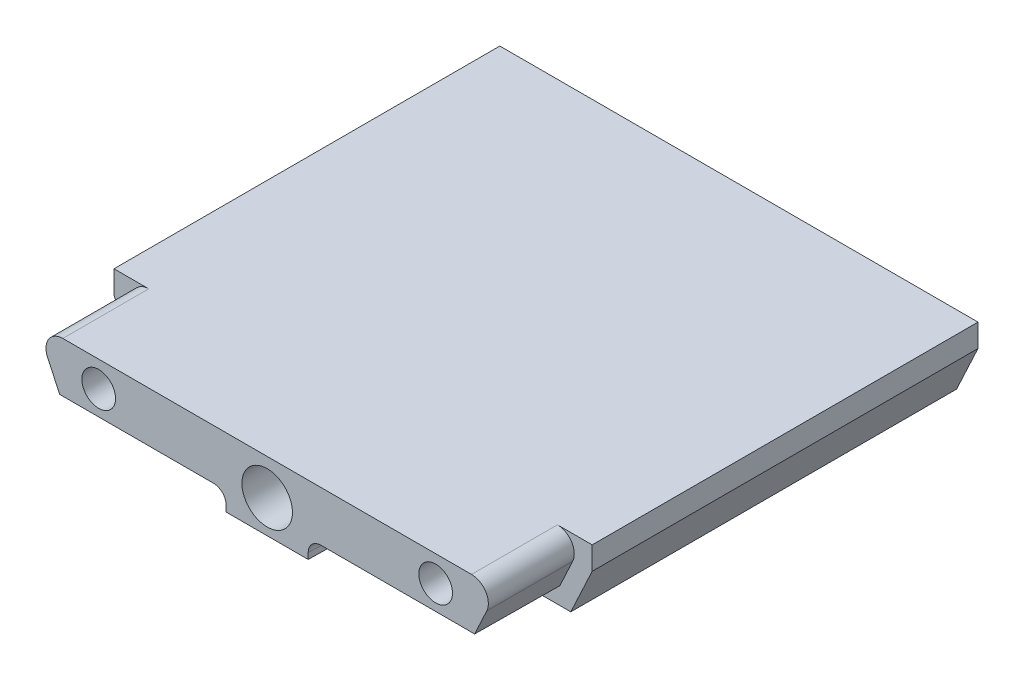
ISO-10303-21;
HEADER;
FILE_DESCRIPTION(('STEP AP214'),'2;1');
FILE_NAME('part.step','',(''),(''),'','','');
FILE_SCHEMA(('AUTOMOTIVE_DESIGN { 1 0 10303 214 1 1 1 1 }'));
ENDSEC;
DATA;
#1=APPLICATION_CONTEXT('core data for automotive mechanical design processes');
#2=APPLICATION_PROTOCOL_DEFINITION('international standard','automotive_design',2000,#1);
#3=PRODUCT_CONTEXT('',#1,'mechanical');
#4=PRODUCT('Part','Part','',(#3));
#5=PRODUCT_RELATED_PRODUCT_CATEGORY('part','',(#4));
#6=PRODUCT_DEFINITION_FORMATION('','',#4);
#7=PRODUCT_DEFINITION_CONTEXT('part definition',#1,'design');
#8=PRODUCT_DEFINITION('design','',#6,#7);
#9=PRODUCT_DEFINITION_SHAPE('','',#8);
#10=(LENGTH_UNIT() NAMED_UNIT(*) SI_UNIT(.MILLI.,.METRE.));
#11=(NAMED_UNIT(*) PLANE_ANGLE_UNIT() SI_UNIT($,.RADIAN.));
#12=(NAMED_UNIT(*) SI_UNIT($,.STERADIAN.) SOLID_ANGLE_UNIT());
#13=UNCERTAINTY_MEASURE_WITH_UNIT(LENGTH_MEASURE(1.E-05),#10,'distance_accuracy_value','');
#14=(GEOMETRIC_REPRESENTATION_CONTEXT(3) GLOBAL_UNCERTAINTY_ASSIGNED_CONTEXT((#13)) GLOBAL_UNIT_ASSIGNED_CONTEXT((#10,
#11,#12)) REPRESENTATION_CONTEXT('',''));
#15=CARTESIAN_POINT('',(0.,0.,0.));
#16=DIRECTION('',(0.,0.,1.));
#17=DIRECTION('',(1.,0.,0.));
#18=AXIS2_PLACEMENT_3D('',#15,#16,#17);
#19=CARTESIAN_POINT('',(24.5440385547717,-62.475,-10.2));
#20=DIRECTION('',(0.90630778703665,-0.422618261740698,0.));
#21=DIRECTION('',(0.422618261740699,0.90630778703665,0.));
#22=AXIS2_PLACEMENT_3D('',#19,#20,#21);
#23=PLANE('',#22);
#24=DIRECTION('',(0.422618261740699,0.90630778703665,0.));
#25=VECTOR('',#24,1.);
#26=CARTESIAN_POINT('',(52.4042644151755,-2.72855283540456,0.));
#27=LINE('',#26,#25);
#28=CARTESIAN_POINT('',(24.6270607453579,-62.2969583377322,0.));
#29=VERTEX_POINT('',#28);
#30=CARTESIAN_POINT('',(26.0712879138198,-59.1998031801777,0.));
#31=VERTEX_POINT('',#30);
#32=EDGE_CURVE('E66',#29,#31,#27,.T.);
#33=ORIENTED_EDGE('',*,*,#32,.F.);
#34=DIRECTION('',(-0.00813792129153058,-0.0174518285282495,-0.999814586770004));
#35=VECTOR('',#34,1.);
#36=CARTESIAN_POINT('',(24.5407876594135,-62.4819715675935,-10.5994008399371));
#37=LINE('',#36,#35);
#38=CARTESIAN_POINT('',(24.5440385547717,-62.475,-10.2));
#39=VERTEX_POINT('',#38);
#40=EDGE_CURVE('E166',#39,#29,#37,.F.);
#41=ORIENTED_EDGE('',*,*,#40,.F.);
#42=DIRECTION('',(0.422618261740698,0.90630778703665,0.));
#43=VECTOR('',#42,1.);
#44=CARTESIAN_POINT('',(24.5440385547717,-62.475,-10.2));
#45=LINE('',#44,#43);
#46=CARTESIAN_POINT('',(26.0712879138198,-59.1998031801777,-10.2));
#47=VERTEX_POINT('',#46);
#48=EDGE_CURVE('E109',#39,#47,#45,.T.);
#49=ORIENTED_EDGE('',*,*,#48,.T.);
#50=DIRECTION('',(0.,0.,-1.));
#51=VECTOR('',#50,1.);
#52=CARTESIAN_POINT('',(26.0712879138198,-59.1998031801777,-10.2));
#53=LINE('',#52,#51);
#54=EDGE_CURVE('E97',#31,#47,#53,.T.);
#55=ORIENTED_EDGE('',*,*,#54,.F.);
#56=EDGE_LOOP('',(#33,#41,#49,#55));
#57=FACE_BOUND('',#56,.T.);
#58=ADVANCED_FACE('F16',(#57),#23,.T.);
#59=CARTESIAN_POINT('',(24.258948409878,-56.355,-10.20006));
#60=CARTESIAN_POINT('',(24.9329806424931,-56.3550000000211,-10.20006));
#61=CARTESIAN_POINT('',(25.5862739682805,-56.7160079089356,-10.20006));
#62=CARTESIAN_POINT('',(26.3050556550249,-57.8442691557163,-10.20006));
#63=CARTESIAN_POINT('',(26.3561462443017,-58.5889225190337,-10.20006));
#64=CARTESIAN_POINT('',(26.0712879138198,-59.1998031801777,-10.20006));
#65=CARTESIAN_POINT('',(24.258948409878,-56.355,2.04003));
#66=CARTESIAN_POINT('',(24.9329806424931,-56.3550000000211,2.04003));
#67=CARTESIAN_POINT('',(25.5862739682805,-56.7160079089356,2.04003));
#68=CARTESIAN_POINT('',(26.3050556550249,-57.8442691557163,2.04003));
#69=CARTESIAN_POINT('',(26.3561462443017,-58.5889225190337,2.04003));
#70=CARTESIAN_POINT('',(26.0712879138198,-59.1998031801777,2.04003));
#71=B_SPLINE_SURFACE_WITH_KNOTS('',1,3,((#59,#60,#61,#62,#63,#64),(#65,#66,#67,#68,#69,#70)),
.UNSPECIFIED.,.F.,.F.,.F.,(2,2),(4,2,4),(0.,1.),(5.27986001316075,6.28318530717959,
7.28651060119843),.UNSPECIFIED.);
#72=CARTESIAN_POINT('',(26.0712879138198,-59.1998031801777,-10.2));
#73=CARTESIAN_POINT('',(26.0950491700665,-59.148848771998,-10.2));
#74=CARTESIAN_POINT('',(26.1165166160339,-59.096864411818,-10.2));
#75=CARTESIAN_POINT('',(26.154829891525,-58.9912444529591,-10.2));
#76=CARTESIAN_POINT('',(26.1716777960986,-58.9376096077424,-10.2));
#77=CARTESIAN_POINT('',(26.2151906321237,-58.7750687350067,-10.2));
#78=CARTESIAN_POINT('',(26.2349549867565,-58.6642431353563,-10.2));
#79=CARTESIAN_POINT('',(26.2560487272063,-58.4411030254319,-10.2));
#80=CARTESIAN_POINT('',(26.257405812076,-58.328791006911,-10.2));
#81=CARTESIAN_POINT('',(26.2420058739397,-58.1053256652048,-10.2));
#82=CARTESIAN_POINT('',(26.2252335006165,-57.9941734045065,-10.2));
#83=CARTESIAN_POINT('',(26.1727595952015,-57.7720948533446,-10.2));
#84=CARTESIAN_POINT('',(26.1363999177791,-57.6613200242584,-10.2));
#85=CARTESIAN_POINT('',(26.0677485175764,-57.5013994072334,-10.2));
#86=CARTESIAN_POINT('',(26.0425145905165,-57.449135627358,-10.2));
#87=CARTESIAN_POINT('',(25.9874124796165,-57.3471113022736,-10.2));
#88=CARTESIAN_POINT('',(25.9575447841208,-57.297350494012,-10.2));
#89=CARTESIAN_POINT('',(25.864383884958,-57.1572543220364,-10.2));
#90=CARTESIAN_POINT('',(25.7952160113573,-57.0707453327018,-10.2));
#91=CARTESIAN_POINT('',(25.6434751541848,-56.9104121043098,-10.2));
#92=CARTESIAN_POINT('',(25.5608887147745,-56.8366007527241,-10.2));
#93=CARTESIAN_POINT('',(25.3846429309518,-56.7029854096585,-10.2));
#94=CARTESIAN_POINT('',(25.2909477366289,-56.643228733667,-10.2));
#95=CARTESIAN_POINT('',(25.0950922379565,-56.539356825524,-10.2));
#96=CARTESIAN_POINT('',(24.9929206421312,-56.4952628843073,-10.2));
#97=CARTESIAN_POINT('',(24.786713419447,-56.4255933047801,-10.2));
#98=CARTESIAN_POINT('',(24.6828938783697,-56.3993812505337,-10.2));
#99=CARTESIAN_POINT('',(24.4724152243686,-56.3640635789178,-10.2));
#100=CARTESIAN_POINT('',(24.3657563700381,-56.3549564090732,-10.2));
#101=CARTESIAN_POINT('',(24.258948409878,-56.355,-10.2));
#102=B_SPLINE_CURVE_WITH_KNOTS('',3,(#72,#73,#74,#75,#76,#77,#78,#79,#80,#81,#82,#83,#84,#85,
#86,#87,#88,#89,#90,#91,#92,#93,#94,#95,#96,#97,#98,#99,#100,#101),.UNSPECIFIED.,.F.,.F.,(4,2,2,
2,2,2,2,2,2,2,2,2,2,2,4),(0.,0.168544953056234,0.337014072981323,0.673029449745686,
1.0085391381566,1.34433312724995,1.6921860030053,1.8660924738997,2.03998062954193,
2.37050011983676,2.70135311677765,3.03330448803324,3.36570538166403,3.68555405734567,
4.00537370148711),.UNSPECIFIED.);
#103=CARTESIAN_POINT('',(24.258948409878,-56.355,-10.2));
#104=VERTEX_POINT('',#103);
#105=EDGE_CURVE('E95',#47,#104,#102,.T.);
#106=DIRECTION('',(0.,0.,-1.));
#107=VECTOR('',#106,1.);
#108=CARTESIAN_POINT('',(24.258948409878,-56.355,-10.2));
#109=LINE('',#108,#107);
#110=CARTESIAN_POINT('',(24.258948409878,-56.355,0.));
#111=VERTEX_POINT('',#110);
#112=EDGE_CURVE('E76',#104,#111,#109,.F.);
#113=CARTESIAN_POINT('',(24.258948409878,-56.355,0.));
#114=CARTESIAN_POINT('',(24.315170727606,-56.3549992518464,0.));
#115=CARTESIAN_POINT('',(24.3713570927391,-56.3575126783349,0.));
#116=CARTESIAN_POINT('',(24.4832731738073,-56.3674259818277,0.));
#117=CARTESIAN_POINT('',(24.5390030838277,-56.3748236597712,0.));
#118=CARTESIAN_POINT('',(24.7047044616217,-56.4040803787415,0.));
#119=CARTESIAN_POINT('',(24.8134993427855,-56.4330047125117,0.));
#120=CARTESIAN_POINT('',(25.0246475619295,-56.5081903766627,0.));
#121=CARTESIAN_POINT('',(25.12701034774,-56.5544255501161,0.));
#122=CARTESIAN_POINT('',(25.3230304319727,-56.6628231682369,0.));
#123=CARTESIAN_POINT('',(25.4166802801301,-56.7249990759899,0.));
#124=CARTESIAN_POINT('',(25.595775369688,-56.8664110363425,0.));
#125=CARTESIAN_POINT('',(25.6808051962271,-56.9461795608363,0.));
#126=CARTESIAN_POINT('',(25.7967291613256,-57.0759842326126,0.));
#127=CARTESIAN_POINT('',(25.8334319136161,-57.1209415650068,0.));
#128=CARTESIAN_POINT('',(25.9026101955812,-57.2139983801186,0.));
#129=CARTESIAN_POINT('',(25.9350861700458,-57.2620975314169,0.));
#130=CARTESIAN_POINT('',(26.0226849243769,-57.4057371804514,0.));
#131=CARTESIAN_POINT('',(26.0718570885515,-57.5049848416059,0.));
#132=CARTESIAN_POINT('',(26.1530398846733,-57.7102685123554,0.));
#133=CARTESIAN_POINT('',(26.1850331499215,-57.8163112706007,0.));
#134=CARTESIAN_POINT('',(26.2316450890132,-58.0325124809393,0.));
#135=CARTESIAN_POINT('',(26.2462057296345,-58.1426834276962,0.));
#136=CARTESIAN_POINT('',(26.2575735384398,-58.3640869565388,0.));
#137=CARTESIAN_POINT('',(26.2543566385,-58.4753207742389,0.));
#138=CARTESIAN_POINT('',(26.2303517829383,-58.6916516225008,0.));
#139=CARTESIAN_POINT('',(26.2102319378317,-58.7968217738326,0.));
#140=CARTESIAN_POINT('',(26.1532884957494,-59.0025061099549,0.));
#141=CARTESIAN_POINT('',(26.1164664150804,-59.1030207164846,0.));
#142=CARTESIAN_POINT('',(26.0712879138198,-59.1998031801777,0.));
#143=B_SPLINE_CURVE_WITH_KNOTS('',3,(#113,#114,#115,#116,#117,#118,#119,#120,#121,#122,#123,
#124,#125,#126,#127,#128,#129,#130,#131,#132,#133,#134,#135,#136,#137,#138,#139,#140,#141,#142),
.UNSPECIFIED.,.F.,.F.,(4,2,2,2,2,2,2,2,2,2,2,2,2,2,4),(0.,0.168544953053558,0.337014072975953,
0.673029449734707,1.00853913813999,1.34433312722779,1.69218600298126,1.86609247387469,
2.03998062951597,2.37050011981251,2.70135311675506,3.03330448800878,3.36570538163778,
3.68555405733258,4.00537370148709),.UNSPECIFIED.);
#144=EDGE_CURVE('E84',#111,#31,#143,.T.);
#145=ORIENTED_EDGE('',*,*,#105,.T.);
#146=ORIENTED_EDGE('',*,*,#112,.T.);
#147=ORIENTED_EDGE('',*,*,#144,.T.);
#148=ORIENTED_EDGE('',*,*,#54,.T.);
#149=EDGE_LOOP('',(#145,#146,#147,#148));
#150=FACE_BOUND('',#149,.T.);
#151=ADVANCED_FACE('F93',(#150),#71,.T.);
#152=CARTESIAN_POINT('',(5.049,41.565,-10.2));
#153=DIRECTION('',(-0.999847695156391,0.,-0.0174524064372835));
#154=DIRECTION('',(-0.0174524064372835,0.,0.999847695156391));
#155=AXIS2_PLACEMENT_3D('',#152,#153,#154);
#156=PLANE('',#155);
#157=DIRECTION('',(0.0174524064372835,0.,-0.999847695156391));
#158=VECTOR('',#157,1.);
#159=CARTESIAN_POINT('',(5.049,-64.515,-10.2));
#160=LINE('',#159,#158);
#161=CARTESIAN_POINT('',(5.04899999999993,-64.515,-10.2));
#162=VERTEX_POINT('',#161);
#163=CARTESIAN_POINT('',(4.87095833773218,-64.515,0.));
#164=VERTEX_POINT('',#163);
#165=EDGE_CURVE('E315',#162,#164,#160,.F.);
#166=ORIENTED_EDGE('',*,*,#165,.F.);
#167=DIRECTION('',(0.,-1.,0.));
#168=VECTOR('',#167,1.);
#169=CARTESIAN_POINT('',(5.049,41.565,-10.2));
#170=LINE('',#169,#168);
#171=CARTESIAN_POINT('',(5.049,-63.9747715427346,-10.2));
#172=VERTEX_POINT('',#171);
#173=EDGE_CURVE('E222',#172,#162,#170,.T.);
#174=ORIENTED_EDGE('',*,*,#173,.F.);
#175=DIRECTION('',(0.0174497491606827,-0.0174497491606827,-0.999695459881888));
#176=VECTOR('',#175,1.);
#177=CARTESIAN_POINT('',(4.87050167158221,-63.7962732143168,0.026162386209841));
#178=LINE('',#177,#176);
#179=CARTESIAN_POINT('',(4.87095833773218,-63.7967298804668,0.));
#180=VERTEX_POINT('',#179);
#181=EDGE_CURVE('E183',#172,#180,#178,.F.);
#182=ORIENTED_EDGE('',*,*,#181,.T.);
#183=DIRECTION('',(0.,-1.,0.));
#184=VECTOR('',#183,1.);
#185=CARTESIAN_POINT('',(4.87095833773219,41.565,0.));
#186=LINE('',#185,#184);
#187=EDGE_CURVE('E20',#164,#180,#186,.F.);
#188=ORIENTED_EDGE('',*,*,#187,.F.);
#189=EDGE_LOOP('',(#166,#174,#182,#188));
#190=FACE_BOUND('',#189,.T.);
#191=ADVANCED_FACE('F128',(#190),#156,.F.);
#192=CARTESIAN_POINT('',(6.51663534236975,-63.9426353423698,-8.33273970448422));
#193=DIRECTION('',(0.0174497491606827,-0.0174497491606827,-0.999695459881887));
#194=DIRECTION('',(0.,0.999847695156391,-0.0174524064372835));
#195=AXIS2_PLACEMENT_3D('',#192,#193,#194);
#196=CYLINDRICAL_SURFACE('',#195,1.5);
#197=CARTESIAN_POINT('',(6.54922849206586,-63.9752284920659,-10.2));
#198=DIRECTION('',(0.,0.,-1.));
#199=DIRECTION('',(0.707106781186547,-0.707106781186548,0.));
#200=AXIS2_PLACEMENT_3D('',#197,#198,#199);
#201=ELLIPSE('',#200,1.50045694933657,1.5);
#202=CARTESIAN_POINT('',(6.54877154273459,-62.475,-10.2));
#203=VERTEX_POINT('',#202);
#204=EDGE_CURVE('E187',#203,#172,#201,.F.);
#205=ORIENTED_EDGE('',*,*,#204,.F.);
#206=DIRECTION('',(0.0174497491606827,-0.0174497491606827,-0.999695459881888));
#207=VECTOR('',#206,1.);
#208=CARTESIAN_POINT('',(6.54831487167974,-62.4745433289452,-10.1738373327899));
#209=LINE('',#208,#207);
#210=CARTESIAN_POINT('',(6.37072988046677,-62.2969583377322,0.));
#211=VERTEX_POINT('',#210);
#212=EDGE_CURVE('E197',#211,#203,#209,.T.);
#213=ORIENTED_EDGE('',*,*,#212,.F.);
#214=CARTESIAN_POINT('',(6.37118682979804,-63.7971868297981,0.));
#215=DIRECTION('',(0.,0.,1.));
#216=DIRECTION('',(0.707106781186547,-0.707106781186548,0.));
#217=AXIS2_PLACEMENT_3D('',#214,#215,#216);
#218=ELLIPSE('',#217,1.50045694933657,1.5);
#219=EDGE_CURVE('E209',#180,#211,#218,.F.);
#220=ORIENTED_EDGE('',*,*,#219,.F.);
#221=ORIENTED_EDGE('',*,*,#181,.F.);
#222=EDGE_LOOP('',(#205,#213,#220,#221));
#223=FACE_BOUND('',#222,.T.);
#224=ADVANCED_FACE('F454',(#223),#196,.F.);
#225=CARTESIAN_POINT('',(-24.5440385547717,-62.475,-10.2));
#226=DIRECTION('',(0.,0.999847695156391,-0.0174524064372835));
#227=DIRECTION('',(0.,0.0174524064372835,0.999847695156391));
#228=AXIS2_PLACEMENT_3D('',#225,#226,#227);
#229=PLANE('',#228);
#230=DIRECTION('',(-1.,0.,0.));
#231=VECTOR('',#230,1.);
#232=CARTESIAN_POINT('',(-24.5440385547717,-62.2969583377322,0.));
#233=LINE('',#232,#231);
#234=EDGE_CURVE('E98',#211,#29,#233,.F.);
#235=ORIENTED_EDGE('',*,*,#234,.F.);
#236=ORIENTED_EDGE('',*,*,#212,.T.);
#237=DIRECTION('',(1.,0.,0.));
#238=VECTOR('',#237,1.);
#239=CARTESIAN_POINT('',(-24.5440385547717,-62.475,-10.2));
#240=LINE('',#239,#238);
#241=EDGE_CURVE('E194',#203,#39,#240,.T.);
#242=ORIENTED_EDGE('',*,*,#241,.T.);
#243=ORIENTED_EDGE('',*,*,#40,.T.);
#244=EDGE_LOOP('',(#235,#236,#242,#243));
#245=FACE_BOUND('',#244,.T.);
#246=ADVANCED_FACE('F333',(#245),#229,.F.);
#247=CARTESIAN_POINT('',(-26.0712879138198,-59.1998031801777,-10.20006));
#248=CARTESIAN_POINT('',(-26.3561462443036,-58.5889225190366,-10.20006));
#249=CARTESIAN_POINT('',(-26.3050556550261,-57.844269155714,-10.20006));
#250=CARTESIAN_POINT('',(-25.5862739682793,-56.7160079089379,-10.20006));
#251=CARTESIAN_POINT('',(-24.932980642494,-56.3550000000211,-10.20006));
#252=CARTESIAN_POINT('',(-24.2589484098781,-56.355,-10.20006));
#253=CARTESIAN_POINT('',(-26.0712879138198,-59.1998031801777,2.04003));
#254=CARTESIAN_POINT('',(-26.3561462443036,-58.5889225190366,2.04003));
#255=CARTESIAN_POINT('',(-26.3050556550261,-57.844269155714,2.04003));
#256=CARTESIAN_POINT('',(-25.5862739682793,-56.7160079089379,2.04003));
#257=CARTESIAN_POINT('',(-24.932980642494,-56.3550000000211,2.04003));
#258=CARTESIAN_POINT('',(-24.2589484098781,-56.355,2.04003));
#259=B_SPLINE_SURFACE_WITH_KNOTS('',1,3,((#247,#248,#249,#250,#251,#252),(#253,#254,#255,#256,
#257,#258)),.UNSPECIFIED.,.F.,.F.,.F.,(2,2),(4,2,4),(0.,1.),(5.27986001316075,6.28318530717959,
7.28651060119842),.UNSPECIFIED.);
#260=CARTESIAN_POINT('',(-24.2589484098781,-56.355,-10.2));
#261=CARTESIAN_POINT('',(-24.3151707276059,-56.3549992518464,-10.2));
#262=CARTESIAN_POINT('',(-24.3713570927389,-56.3575126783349,-10.2));
#263=CARTESIAN_POINT('',(-24.4832731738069,-56.3674259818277,-10.2));
#264=CARTESIAN_POINT('',(-24.5390030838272,-56.3748236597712,-10.2));
#265=CARTESIAN_POINT('',(-24.7047044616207,-56.4040803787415,-10.2));
#266=CARTESIAN_POINT('',(-24.8134993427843,-56.4330047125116,-10.2));
#267=CARTESIAN_POINT('',(-25.0246475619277,-56.5081903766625,-10.2));
#268=CARTESIAN_POINT('',(-25.1270103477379,-56.5544255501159,-10.2));
#269=CARTESIAN_POINT('',(-25.3230304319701,-56.6628231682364,-10.2));
#270=CARTESIAN_POINT('',(-25.4166802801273,-56.7249990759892,-10.2));
#271=CARTESIAN_POINT('',(-25.5957753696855,-56.8664110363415,-10.2));
#272=CARTESIAN_POINT('',(-25.680805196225,-56.9461795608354,-10.2));
#273=CARTESIAN_POINT('',(-25.7967291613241,-57.0759842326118,-10.2));
#274=CARTESIAN_POINT('',(-25.8334319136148,-57.1209415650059,-10.2));
#275=CARTESIAN_POINT('',(-25.9026101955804,-57.2139983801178,-10.2));
#276=CARTESIAN_POINT('',(-25.9350861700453,-57.262097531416,-10.2));
#277=CARTESIAN_POINT('',(-26.0226849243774,-57.4057371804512,-10.2));
#278=CARTESIAN_POINT('',(-26.0718570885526,-57.5049848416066,-10.2));
#279=CARTESIAN_POINT('',(-26.1530398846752,-57.7102685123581,-10.2));
#280=CARTESIAN_POINT('',(-26.1850331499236,-57.8163112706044,-10.2));
#281=CARTESIAN_POINT('',(-26.2316450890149,-58.0325124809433,-10.2));
#282=CARTESIAN_POINT('',(-26.246205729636,-58.1426834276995,-10.2));
#283=CARTESIAN_POINT('',(-26.257573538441,-58.3640869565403,-10.2));
#284=CARTESIAN_POINT('',(-26.2543566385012,-58.4753207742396,-10.2));
#285=CARTESIAN_POINT('',(-26.2303517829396,-58.6916516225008,-10.2));
#286=CARTESIAN_POINT('',(-26.2102319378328,-58.7968217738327,-10.2));
#287=CARTESIAN_POINT('',(-26.1532884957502,-59.002506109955,-10.2));
#288=CARTESIAN_POINT('',(-26.1164664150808,-59.1030207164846,-10.2));
#289=CARTESIAN_POINT('',(-26.0712879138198,-59.1998031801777,-10.2));
#290=B_SPLINE_CURVE_WITH_KNOTS('',3,(#260,#261,#262,#263,#264,#265,#266,#267,#268,#269,#270,
#271,#272,#273,#274,#275,#276,#277,#278,#279,#280,#281,#282,#283,#284,#285,#286,#287,#288,#289),
.UNSPECIFIED.,.F.,.F.,(4,2,2,2,2,2,2,2,2,2,2,2,2,2,4),(0.,0.168544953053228,0.337014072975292,
0.673029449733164,1.00853913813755,1.34433312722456,1.69218600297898,1.86609247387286,
2.03998062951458,2.37050011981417,2.70135311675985,3.03330448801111,3.36570538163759,
3.68555405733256,4.00537370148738),.UNSPECIFIED.);
#291=CARTESIAN_POINT('',(-24.2589484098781,-56.355,-10.2));
#292=VERTEX_POINT('',#291);
#293=CARTESIAN_POINT('',(-26.0712879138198,-59.1998031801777,-10.2));
#294=VERTEX_POINT('',#293);
#295=EDGE_CURVE('E108',#292,#294,#290,.T.);
#296=DIRECTION('',(0.,0.,-1.));
#297=VECTOR('',#296,1.);
#298=CARTESIAN_POINT('',(-26.0712879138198,-59.1998031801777,-10.2));
#299=LINE('',#298,#297);
#300=CARTESIAN_POINT('',(-26.0712879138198,-59.1998031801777,0.));
#301=VERTEX_POINT('',#300);
#302=EDGE_CURVE('E36',#294,#301,#299,.F.);
#303=CARTESIAN_POINT('',(-26.0712879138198,-59.1998031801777,0.));
#304=CARTESIAN_POINT('',(-26.0950491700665,-59.1488487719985,0.));
#305=CARTESIAN_POINT('',(-26.1165166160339,-59.0968644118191,0.));
#306=CARTESIAN_POINT('',(-26.1548298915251,-58.9912444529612,0.));
#307=CARTESIAN_POINT('',(-26.1716777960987,-58.9376096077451,0.));
#308=CARTESIAN_POINT('',(-26.2151906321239,-58.775068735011,0.));
#309=CARTESIAN_POINT('',(-26.2349549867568,-58.6642431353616,0.));
#310=CARTESIAN_POINT('',(-26.2560487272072,-58.4411030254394,0.));
#311=CARTESIAN_POINT('',(-26.2574058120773,-58.3287910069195,0.));
#312=CARTESIAN_POINT('',(-26.2420058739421,-58.1053256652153,0.));
#313=CARTESIAN_POINT('',(-26.2252335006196,-57.9941734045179,0.));
#314=CARTESIAN_POINT('',(-26.1727595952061,-57.7720948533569,0.));
#315=CARTESIAN_POINT('',(-26.1363999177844,-57.6613200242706,0.));
#316=CARTESIAN_POINT('',(-26.0677485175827,-57.5013994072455,0.));
#317=CARTESIAN_POINT('',(-26.0425145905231,-57.4491356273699,0.));
#318=CARTESIAN_POINT('',(-25.9874124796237,-57.3471113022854,0.));
#319=CARTESIAN_POINT('',(-25.9575447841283,-57.2973504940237,0.));
#320=CARTESIAN_POINT('',(-25.8643838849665,-57.1572543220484,0.));
#321=CARTESIAN_POINT('',(-25.7952160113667,-57.070745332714,0.));
#322=CARTESIAN_POINT('',(-25.6434751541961,-56.9104121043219,0.));
#323=CARTESIAN_POINT('',(-25.5608887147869,-56.836600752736,0.));
#324=CARTESIAN_POINT('',(-25.3846429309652,-56.7029854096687,0.));
#325=CARTESIAN_POINT('',(-25.2909477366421,-56.6432287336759,0.));
#326=CARTESIAN_POINT('',(-25.095092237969,-56.5393568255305,0.));
#327=CARTESIAN_POINT('',(-24.9929206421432,-56.4952628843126,0.));
#328=CARTESIAN_POINT('',(-24.7867134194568,-56.4255933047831,0.));
#329=CARTESIAN_POINT('',(-24.6828938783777,-56.3993812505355,0.));
#330=CARTESIAN_POINT('',(-24.4724152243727,-56.3640635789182,0.));
#331=CARTESIAN_POINT('',(-24.3657563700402,-56.3549564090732,0.));
#332=CARTESIAN_POINT('',(-24.2589484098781,-56.355,0.));
#333=B_SPLINE_CURVE_WITH_KNOTS('',3,(#303,#304,#305,#306,#307,#308,#309,#310,#311,#312,#313,
#314,#315,#316,#317,#318,#319,#320,#321,#322,#323,#324,#325,#326,#327,#328,#329,#330,#331,#332),
.UNSPECIFIED.,.F.,.F.,(4,2,2,2,2,2,2,2,2,2,2,2,2,2,4),(0.,0.168544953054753,0.337014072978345,
0.673029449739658,1.00853913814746,1.34433312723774,1.69218600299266,1.86609247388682,
2.03998062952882,2.37050011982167,2.70135311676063,3.03330448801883,3.36570538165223,
3.68555405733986,4.0053737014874),.UNSPECIFIED.);
#334=CARTESIAN_POINT('',(-24.2589484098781,-56.355,0.));
#335=VERTEX_POINT('',#334);
#336=EDGE_CURVE('E91',#301,#335,#333,.T.);
#337=DIRECTION('',(0.,0.,-1.));
#338=VECTOR('',#337,1.);
#339=CARTESIAN_POINT('',(-24.2589484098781,-56.355,-10.2));
#340=LINE('',#339,#338);
#341=EDGE_CURVE('E79',#335,#292,#340,.T.);
#342=ORIENTED_EDGE('',*,*,#295,.T.);
#343=ORIENTED_EDGE('',*,*,#302,.T.);
#344=ORIENTED_EDGE('',*,*,#336,.T.);
#345=ORIENTED_EDGE('',*,*,#341,.T.);
#346=EDGE_LOOP('',(#342,#343,#344,#345));
#347=FACE_BOUND('',#346,.T.);
#348=ADVANCED_FACE('F129',(#347),#259,.T.);
#349=CARTESIAN_POINT('',(-27.3978414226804,-56.355,-10.2));
#350=DIRECTION('',(-0.90630778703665,-0.422618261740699,0.));
#351=DIRECTION('',(0.422618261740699,-0.90630778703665,0.));
#352=AXIS2_PLACEMENT_3D('',#349,#350,#351);
#353=PLANE('',#352);
#354=ORIENTED_EDGE('',*,*,#302,.F.);
#355=DIRECTION('',(0.422618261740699,-0.90630778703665,0.));
#356=VECTOR('',#355,1.);
#357=CARTESIAN_POINT('',(-27.3978414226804,-56.355,-10.2));
#358=LINE('',#357,#356);
#359=CARTESIAN_POINT('',(-24.5440385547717,-62.475,-10.2));
#360=VERTEX_POINT('',#359);
#361=EDGE_CURVE('E229',#294,#360,#358,.T.);
#362=ORIENTED_EDGE('',*,*,#361,.T.);
#363=DIRECTION('',(0.00813792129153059,-0.0174518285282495,-0.999814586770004));
#364=VECTOR('',#363,1.);
#365=CARTESIAN_POINT('',(-24.5450967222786,-62.4727307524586,-10.069994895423));
#366=LINE('',#365,#364);
#367=CARTESIAN_POINT('',(-24.6270607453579,-62.2969583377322,0.));
#368=VERTEX_POINT('',#367);
#369=EDGE_CURVE('E162',#360,#368,#366,.F.);
#370=ORIENTED_EDGE('',*,*,#369,.T.);
#371=DIRECTION('',(0.422618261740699,-0.90630778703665,0.));
#372=VECTOR('',#371,1.);
#373=CARTESIAN_POINT('',(-85.1963618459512,67.5943270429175,0.));
#374=LINE('',#373,#372);
#375=EDGE_CURVE('E82',#301,#368,#374,.T.);
#376=ORIENTED_EDGE('',*,*,#375,.F.);
#377=EDGE_LOOP('',(#354,#362,#370,#376));
#378=FACE_BOUND('',#377,.T.);
#379=ADVANCED_FACE('F18',(#378),#353,.T.);
#380=CARTESIAN_POINT('',(-24.5440385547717,-62.475,-10.2));
#381=DIRECTION('',(0.,0.999847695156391,-0.0174524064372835));
#382=DIRECTION('',(0.,0.0174524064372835,0.999847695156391));
#383=AXIS2_PLACEMENT_3D('',#380,#381,#382);
#384=PLANE('',#383);
#385=DIRECTION('',(1.,0.,0.));
#386=VECTOR('',#385,1.);
#387=CARTESIAN_POINT('',(-24.5440385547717,-62.475,-10.2));
#388=LINE('',#387,#386);
#389=CARTESIAN_POINT('',(-6.54877154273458,-62.475,-10.2));
#390=VERTEX_POINT('',#389);
#391=EDGE_CURVE('E231',#360,#390,#388,.T.);
#392=ORIENTED_EDGE('',*,*,#391,.T.);
#393=DIRECTION('',(0.0174497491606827,0.0174497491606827,0.999695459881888));
#394=VECTOR('',#393,1.);
#395=CARTESIAN_POINT('',(-6.37027320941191,-62.2965016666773,0.0261626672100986));
#396=LINE('',#395,#394);
#397=CARTESIAN_POINT('',(-6.37072988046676,-62.2969583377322,0.));
#398=VERTEX_POINT('',#397);
#399=EDGE_CURVE('E203',#390,#398,#396,.T.);
#400=ORIENTED_EDGE('',*,*,#399,.T.);
#401=DIRECTION('',(-1.,0.,0.));
#402=VECTOR('',#401,1.);
#403=CARTESIAN_POINT('',(-24.5440385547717,-62.2969583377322,0.));
#404=LINE('',#403,#402);
#405=EDGE_CURVE('E81',#368,#398,#404,.F.);
#406=ORIENTED_EDGE('',*,*,#405,.F.);
#407=ORIENTED_EDGE('',*,*,#369,.F.);
#408=EDGE_LOOP('',(#392,#400,#406,#407));
#409=FACE_BOUND('',#408,.T.);
#410=ADVANCED_FACE('F335',(#409),#384,.F.);
#411=CARTESIAN_POINT('',(-6.51663534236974,-63.9426353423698,-8.33273970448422));
#412=DIRECTION('',(0.0174497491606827,0.0174497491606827,0.999695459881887));
#413=DIRECTION('',(0.999847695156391,0.,-0.0174524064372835));
#414=AXIS2_PLACEMENT_3D('',#411,#412,#413);
#415=CYLINDRICAL_SURFACE('',#414,1.5);
#416=CARTESIAN_POINT('',(-6.37118682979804,-63.7971868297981,0.));
#417=DIRECTION('',(0.,0.,1.));
#418=DIRECTION('',(0.707106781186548,0.707106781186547,0.));
#419=AXIS2_PLACEMENT_3D('',#416,#417,#418);
#420=ELLIPSE('',#419,1.50045694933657,1.5);
#421=CARTESIAN_POINT('',(-4.87095833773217,-63.7967298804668,0.));
#422=VERTEX_POINT('',#421);
#423=EDGE_CURVE('E218',#398,#422,#420,.F.);
#424=ORIENTED_EDGE('',*,*,#423,.F.);
#425=ORIENTED_EDGE('',*,*,#399,.F.);
#426=CARTESIAN_POINT('',(-6.54922849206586,-63.9752284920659,-10.2));
#427=DIRECTION('',(0.,0.,-1.));
#428=DIRECTION('',(0.707106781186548,0.707106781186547,0.));
#429=AXIS2_PLACEMENT_3D('',#426,#427,#428);
#430=ELLIPSE('',#429,1.50045694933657,1.5);
#431=CARTESIAN_POINT('',(-5.049,-63.9747715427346,-10.2));
#432=VERTEX_POINT('',#431);
#433=EDGE_CURVE('E27',#432,#390,#430,.F.);
#434=ORIENTED_EDGE('',*,*,#433,.F.);
#435=DIRECTION('',(0.0174497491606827,0.0174497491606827,0.999695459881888));
#436=VECTOR('',#435,1.);
#437=CARTESIAN_POINT('',(-5.04854332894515,-63.9743148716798,-10.1738373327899));
#438=LINE('',#437,#436);
#439=EDGE_CURVE('E189',#422,#432,#438,.F.);
#440=ORIENTED_EDGE('',*,*,#439,.F.);
#441=EDGE_LOOP('',(#424,#425,#434,#440));
#442=FACE_BOUND('',#441,.T.);
#443=ADVANCED_FACE('F241',(#442),#415,.F.);
#444=CARTESIAN_POINT('',(-5.049,41.565,-10.2));
#445=DIRECTION('',(0.999847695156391,0.,-0.0174524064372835));
#446=DIRECTION('',(-0.0174524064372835,0.,-0.999847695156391));
#447=AXIS2_PLACEMENT_3D('',#444,#445,#446);
#448=PLANE('',#447);
#449=DIRECTION('',(0.0174524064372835,0.,0.999847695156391));
#450=VECTOR('',#449,1.);
#451=CARTESIAN_POINT('',(-5.049,-64.515,-10.2));
#452=LINE('',#451,#450);
#453=CARTESIAN_POINT('',(-4.87095833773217,-64.515,0.));
#454=VERTEX_POINT('',#453);
#455=CARTESIAN_POINT('',(-5.049,-64.515,-10.2));
#456=VERTEX_POINT('',#455);
#457=EDGE_CURVE('E326',#454,#456,#452,.F.);
#458=ORIENTED_EDGE('',*,*,#457,.F.);
#459=DIRECTION('',(0.,1.,0.));
#460=VECTOR('',#459,1.);
#461=CARTESIAN_POINT('',(-4.87095833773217,64.515,0.));
#462=LINE('',#461,#460);
#463=EDGE_CURVE('E172',#422,#454,#462,.F.);
#464=ORIENTED_EDGE('',*,*,#463,.F.);
#465=ORIENTED_EDGE('',*,*,#439,.T.);
#466=DIRECTION('',(0.,-1.,0.));
#467=VECTOR('',#466,1.);
#468=CARTESIAN_POINT('',(-5.049,41.565,-10.2));
#469=LINE('',#468,#467);
#470=EDGE_CURVE('E11',#456,#432,#469,.F.);
#471=ORIENTED_EDGE('',*,*,#470,.F.);
#472=EDGE_LOOP('',(#458,#464,#465,#471));
#473=FACE_BOUND('',#472,.T.);
#474=ADVANCED_FACE('F154',(#473),#448,.F.);
#475=CARTESIAN_POINT('',(5.049,-56.355,-10.2));
#476=DIRECTION('',(0.,1.,0.));
#477=DIRECTION('',(-1.,0.,0.));
#478=AXIS2_PLACEMENT_3D('',#475,#476,#477);
#479=PLANE('',#478);
#480=ORIENTED_EDGE('',*,*,#341,.F.);
#481=DIRECTION('',(-1.,0.,0.));
#482=VECTOR('',#481,1.);
#483=CARTESIAN_POINT('',(-91.8,-56.355,0.));
#484=LINE('',#483,#482);
#485=EDGE_CURVE('E72',#111,#335,#484,.T.);
#486=ORIENTED_EDGE('',*,*,#485,.F.);
#487=ORIENTED_EDGE('',*,*,#112,.F.);
#488=DIRECTION('',(1.,0.,0.));
#489=VECTOR('',#488,1.);
#490=CARTESIAN_POINT('',(5.049,-56.355,-10.2));
#491=LINE('',#490,#489);
#492=CARTESIAN_POINT('',(28.3813369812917,-56.355,-10.2));
#493=VERTEX_POINT('',#492);
#494=EDGE_CURVE('E344',#104,#493,#491,.T.);
#495=ORIENTED_EDGE('',*,*,#494,.T.);
#496=DIRECTION('',(0.,0.,1.));
#497=VECTOR('',#496,1.);
#498=CARTESIAN_POINT('',(28.3813369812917,-56.355,-60.2));
#499=LINE('',#498,#497);
#500=CARTESIAN_POINT('',(28.3813369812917,-56.355,-56.));
#501=VERTEX_POINT('',#500);
#502=EDGE_CURVE('E413',#501,#493,#499,.T.);
#503=ORIENTED_EDGE('',*,*,#502,.F.);
#504=DIRECTION('',(-1.,0.,0.));
#505=VECTOR('',#504,1.);
#506=CARTESIAN_POINT('',(5.049,-56.355,-56.));
#507=LINE('',#506,#505);
#508=CARTESIAN_POINT('',(-28.3825796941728,-56.355,-56.));
#509=VERTEX_POINT('',#508);
#510=EDGE_CURVE('E381',#509,#501,#507,.F.);
#511=ORIENTED_EDGE('',*,*,#510,.F.);
#512=DIRECTION('',(0.,0.,1.));
#513=VECTOR('',#512,1.);
#514=CARTESIAN_POINT('',(-28.3825796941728,-56.355,-60.2));
#515=LINE('',#514,#513);
#516=CARTESIAN_POINT('',(-28.3825796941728,-56.355,-10.2));
#517=VERTEX_POINT('',#516);
#518=EDGE_CURVE('E343',#509,#517,#515,.T.);
#519=ORIENTED_EDGE('',*,*,#518,.T.);
#520=EDGE_CURVE('E338',#517,#292,#491,.T.);
#521=ORIENTED_EDGE('',*,*,#520,.T.);
#522=EDGE_LOOP('',(#480,#486,#487,#495,#503,#511,#519,#521));
#523=FACE_BOUND('',#522,.T.);
#524=ADVANCED_FACE('F73',(#523),#479,.T.);
#525=CARTESIAN_POINT('',(-19.9999919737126,-59.4150083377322,-1049.4));
#526=DIRECTION('',(0.,0.,1.));
#527=DIRECTION('',(1.,0.,0.));
#528=AXIS2_PLACEMENT_3D('',#525,#526,#527);
#529=CYLINDRICAL_SURFACE('',#528,2.);
#530=CARTESIAN_POINT('',(-19.9999919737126,-59.4150083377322,0.));
#531=DIRECTION('',(0.,0.,1.));
#532=DIRECTION('',(0.,1.,0.));
#533=AXIS2_PLACEMENT_3D('',#530,#531,#532);
#534=CIRCLE('',#533,2.);
#535=CARTESIAN_POINT('',(-19.9999919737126,-57.4150083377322,0.));
#536=VERTEX_POINT('',#535);
#537=EDGE_CURVE('E164',#536,#536,#534,.T.);
#538=ORIENTED_EDGE('',*,*,#537,.T.);
#539=EDGE_LOOP('',(#538));
#540=FACE_BOUND('',#539,.T.);
#541=CARTESIAN_POINT('',(-19.9999919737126,-59.4150083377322,-56.));
#542=DIRECTION('',(0.,0.,1.));
#543=DIRECTION('',(1.,0.,0.));
#544=AXIS2_PLACEMENT_3D('',#541,#542,#543);
#545=CIRCLE('',#544,2.);
#546=CARTESIAN_POINT('',(-17.9999919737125,-59.4150083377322,-56.));
#547=VERTEX_POINT('',#546);
#548=EDGE_CURVE('E379',#547,#547,#545,.T.);
#549=ORIENTED_EDGE('',*,*,#548,.F.);
#550=EDGE_LOOP('',(#549));
#551=FACE_BOUND('',#550,.T.);
#552=ADVANCED_FACE('F152',(#540,#551),#529,.F.);
#553=CARTESIAN_POINT('',(8.02628750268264E-06,-60.613025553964,-1049.4));
#554=DIRECTION('',(0.,0.,1.));
#555=DIRECTION('',(1.,0.,0.));
#556=AXIS2_PLACEMENT_3D('',#553,#554,#555);
#557=CYLINDRICAL_SURFACE('',#556,3.);
#558=CARTESIAN_POINT('',(8.02628750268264E-06,-60.613025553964,0.));
#559=DIRECTION('',(0.,0.,1.));
#560=DIRECTION('',(0.,1.,0.));
#561=AXIS2_PLACEMENT_3D('',#558,#559,#560);
#562=CIRCLE('',#561,3.);
#563=CARTESIAN_POINT('',(8.02628750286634E-06,-57.613025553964,0.));
#564=VERTEX_POINT('',#563);
#565=EDGE_CURVE('E368',#564,#564,#562,.T.);
#566=ORIENTED_EDGE('',*,*,#565,.T.);
#567=EDGE_LOOP('',(#566));
#568=FACE_BOUND('',#567,.T.);
#569=CARTESIAN_POINT('',(8.02628750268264E-06,-60.613025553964,-56.));
#570=DIRECTION('',(0.,0.,1.));
#571=DIRECTION('',(1.,0.,0.));
#572=AXIS2_PLACEMENT_3D('',#569,#570,#571);
#573=CIRCLE('',#572,3.);
#574=CARTESIAN_POINT('',(3.0000080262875,-60.613025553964,-56.));
#575=VERTEX_POINT('',#574);
#576=EDGE_CURVE('E382',#575,#575,#573,.T.);
#577=ORIENTED_EDGE('',*,*,#576,.F.);
#578=EDGE_LOOP('',(#577));
#579=FACE_BOUND('',#578,.T.);
#580=ADVANCED_FACE('F151',(#568,#579),#557,.F.);
#581=CARTESIAN_POINT('',(-91.8,64.515,0.));
#582=DIRECTION('',(0.,0.,1.));
#583=DIRECTION('',(1.,0.,0.));
#584=AXIS2_PLACEMENT_3D('',#581,#582,#583);
#585=PLANE('',#584);
#586=DIRECTION('',(-1.,0.,0.));
#587=VECTOR('',#586,1.);
#588=CARTESIAN_POINT('',(-91.8,-64.515,0.));
#589=LINE('',#588,#587);
#590=EDGE_CURVE('E671',#164,#454,#589,.T.);
#591=ORIENTED_EDGE('',*,*,#590,.F.);
#592=ORIENTED_EDGE('',*,*,#187,.T.);
#593=ORIENTED_EDGE('',*,*,#219,.T.);
#594=ORIENTED_EDGE('',*,*,#234,.T.);
#595=ORIENTED_EDGE('',*,*,#32,.T.);
#596=ORIENTED_EDGE('',*,*,#144,.F.);
#597=ORIENTED_EDGE('',*,*,#485,.T.);
#598=ORIENTED_EDGE('',*,*,#336,.F.);
#599=ORIENTED_EDGE('',*,*,#375,.T.);
#600=ORIENTED_EDGE('',*,*,#405,.T.);
#601=ORIENTED_EDGE('',*,*,#423,.T.);
#602=ORIENTED_EDGE('',*,*,#463,.T.);
#603=EDGE_LOOP('',(#591,#592,#593,#594,#595,#596,#597,#598,#599,#600,#601,#602));
#604=FACE_BOUND('',#603,.T.);
#605=CARTESIAN_POINT('',(20.0000080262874,-59.4150083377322,0.));
#606=DIRECTION('',(0.,0.,1.));
#607=DIRECTION('',(0.,1.,0.));
#608=AXIS2_PLACEMENT_3D('',#605,#606,#607);
#609=CIRCLE('',#608,2.);
#610=CARTESIAN_POINT('',(20.0000080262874,-57.4150083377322,0.));
#611=VERTEX_POINT('',#610);
#612=EDGE_CURVE('E365',#611,#611,#609,.T.);
#613=ORIENTED_EDGE('',*,*,#612,.F.);
#614=EDGE_LOOP('',(#613));
#615=FACE_BOUND('',#614,.T.);
#616=ORIENTED_EDGE('',*,*,#565,.F.);
#617=EDGE_LOOP('',(#616));
#618=FACE_BOUND('',#617,.T.);
#619=ORIENTED_EDGE('',*,*,#537,.F.);
#620=EDGE_LOOP('',(#619));
#621=FACE_BOUND('',#620,.T.);
#622=ADVANCED_FACE('F86',(#604,#615,#618,#621),#585,.T.);
#623=CARTESIAN_POINT('',(20.0000080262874,-59.4150083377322,-1049.4));
#624=DIRECTION('',(0.,0.,1.));
#625=DIRECTION('',(1.,0.,0.));
#626=AXIS2_PLACEMENT_3D('',#623,#624,#625);
#627=CYLINDRICAL_SURFACE('',#626,2.);
#628=ORIENTED_EDGE('',*,*,#612,.T.);
#629=EDGE_LOOP('',(#628));
#630=FACE_BOUND('',#629,.T.);
#631=CARTESIAN_POINT('',(20.0000080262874,-59.4150083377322,-56.));
#632=DIRECTION('',(0.,0.,1.));
#633=DIRECTION('',(1.,0.,0.));
#634=AXIS2_PLACEMENT_3D('',#631,#632,#633);
#635=CIRCLE('',#634,2.);
#636=CARTESIAN_POINT('',(22.0000080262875,-59.4150083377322,-56.));
#637=VERTEX_POINT('',#636);
#638=EDGE_CURVE('E387',#637,#637,#635,.T.);
#639=ORIENTED_EDGE('',*,*,#638,.F.);
#640=EDGE_LOOP('',(#639));
#641=FACE_BOUND('',#640,.T.);
#642=ADVANCED_FACE('F150',(#630,#641),#627,.F.);
#643=CARTESIAN_POINT('',(5.049,41.565,-10.2));
#644=DIRECTION('',(0.,0.,-1.));
#645=DIRECTION('',(-1.,0.,0.));
#646=AXIS2_PLACEMENT_3D('',#643,#644,#645);
#647=PLANE('',#646);
#648=DIRECTION('',(-1.,0.,0.));
#649=VECTOR('',#648,1.);
#650=CARTESIAN_POINT('',(25.843661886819,-64.515,-10.2));
#651=LINE('',#650,#649);
#652=CARTESIAN_POINT('',(-25.843661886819,-64.515,-10.2));
#653=VERTEX_POINT('',#652);
#654=EDGE_CURVE('E325',#456,#653,#651,.T.);
#655=ORIENTED_EDGE('',*,*,#654,.F.);
#656=ORIENTED_EDGE('',*,*,#470,.T.);
#657=ORIENTED_EDGE('',*,*,#433,.T.);
#658=ORIENTED_EDGE('',*,*,#391,.F.);
#659=ORIENTED_EDGE('',*,*,#361,.F.);
#660=ORIENTED_EDGE('',*,*,#295,.F.);
#661=ORIENTED_EDGE('',*,*,#520,.F.);
#662=DIRECTION('',(-0.000304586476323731,-0.999999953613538,0.));
#663=VECTOR('',#662,1.);
#664=CARTESIAN_POINT('',(-28.3825796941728,-56.355,-10.2));
#665=LINE('',#664,#663);
#666=CARTESIAN_POINT('',(-28.3834061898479,-59.0685007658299,-10.2));
#667=VERTEX_POINT('',#666);
#668=EDGE_CURVE('E346',#517,#667,#665,.T.);
#669=ORIENTED_EDGE('',*,*,#668,.T.);
#670=DIRECTION('',(-0.422618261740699,0.90630778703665,0.));
#671=VECTOR('',#670,1.);
#672=CARTESIAN_POINT('',(-25.843661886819,-64.515,-10.2));
#673=LINE('',#672,#671);
#674=EDGE_CURVE('E355',#653,#667,#673,.T.);
#675=ORIENTED_EDGE('',*,*,#674,.F.);
#676=EDGE_LOOP('',(#655,#656,#657,#658,#659,#660,#661,#669,#675));
#677=FACE_BOUND('',#676,.T.);
#678=ADVANCED_FACE('F237',(#677),#647,.F.);
#679=ORIENTED_EDGE('',*,*,#204,.T.);
#680=ORIENTED_EDGE('',*,*,#173,.T.);
#681=DIRECTION('',(-1.,0.,0.));
#682=VECTOR('',#681,1.);
#683=CARTESIAN_POINT('',(25.843661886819,-64.515,-10.2));
#684=LINE('',#683,#682);
#685=CARTESIAN_POINT('',(25.843661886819,-64.515,-10.2));
#686=VERTEX_POINT('',#685);
#687=EDGE_CURVE('E312',#686,#162,#684,.T.);
#688=ORIENTED_EDGE('',*,*,#687,.F.);
#689=DIRECTION('',(-0.422618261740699,-0.90630778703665,0.));
#690=VECTOR('',#689,1.);
#691=CARTESIAN_POINT('',(30.6,-54.315,-10.2));
#692=LINE('',#691,#690);
#693=CARTESIAN_POINT('',(28.3805085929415,-59.0747146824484,-10.2));
#694=VERTEX_POINT('',#693);
#695=EDGE_CURVE('E348',#694,#686,#692,.T.);
#696=ORIENTED_EDGE('',*,*,#695,.F.);
#697=DIRECTION('',(0.000304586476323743,0.999999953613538,0.));
#698=VECTOR('',#697,1.);
#699=CARTESIAN_POINT('',(28.3805085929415,-59.0747146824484,-10.2));
#700=LINE('',#699,#698);
#701=EDGE_CURVE('E396',#694,#493,#700,.T.);
#702=ORIENTED_EDGE('',*,*,#701,.T.);
#703=ORIENTED_EDGE('',*,*,#494,.F.);
#704=ORIENTED_EDGE('',*,*,#105,.F.);
#705=ORIENTED_EDGE('',*,*,#48,.F.);
#706=ORIENTED_EDGE('',*,*,#241,.F.);
#707=EDGE_LOOP('',(#679,#680,#688,#696,#702,#703,#704,#705,#706));
#708=FACE_BOUND('',#707,.T.);
#709=ADVANCED_FACE('F329',(#708),#647,.F.);
#710=CARTESIAN_POINT('',(25.843661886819,-64.515,-61.719588));
#711=DIRECTION('',(0.,1.,0.));
#712=DIRECTION('',(0.,0.,1.));
#713=AXIS2_PLACEMENT_3D('',#710,#711,#712);
#714=PLANE('',#713);
#715=ORIENTED_EDGE('',*,*,#687,.T.);
#716=ORIENTED_EDGE('',*,*,#165,.T.);
#717=ORIENTED_EDGE('',*,*,#590,.T.);
#718=ORIENTED_EDGE('',*,*,#457,.T.);
#719=ORIENTED_EDGE('',*,*,#654,.T.);
#720=DIRECTION('',(0.,0.,1.));
#721=VECTOR('',#720,1.);
#722=CARTESIAN_POINT('',(-25.843661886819,-64.515,-61.719588));
#723=LINE('',#722,#721);
#724=CARTESIAN_POINT('',(-25.843661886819,-64.515,-56.));
#725=VERTEX_POINT('',#724);
#726=EDGE_CURVE('E653',#725,#653,#723,.T.);
#727=ORIENTED_EDGE('',*,*,#726,.F.);
#728=DIRECTION('',(1.,0.,0.));
#729=VECTOR('',#728,1.);
#730=CARTESIAN_POINT('',(25.843661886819,-64.515,-56.));
#731=LINE('',#730,#729);
#732=CARTESIAN_POINT('',(25.843661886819,-64.515,-56.));
#733=VERTEX_POINT('',#732);
#734=EDGE_CURVE('E651',#725,#733,#731,.T.);
#735=ORIENTED_EDGE('',*,*,#734,.T.);
#736=DIRECTION('',(0.,0.,1.));
#737=VECTOR('',#736,1.);
#738=CARTESIAN_POINT('',(25.843661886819,-64.515,-61.719588));
#739=LINE('',#738,#737);
#740=EDGE_CURVE('E317',#733,#686,#739,.T.);
#741=ORIENTED_EDGE('',*,*,#740,.T.);
#742=EDGE_LOOP('',(#715,#716,#717,#718,#719,#727,#735,#741));
#743=FACE_BOUND('',#742,.T.);
#744=ADVANCED_FACE('F314',(#743),#714,.F.);
#745=CARTESIAN_POINT('',(170.,-124.,-56.));
#746=DIRECTION('',(0.,0.,1.));
#747=DIRECTION('',(1.,0.,0.));
#748=AXIS2_PLACEMENT_3D('',#745,#746,#747);
#749=PLANE('',#748);
#750=CARTESIAN_POINT('',(10.0000080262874,-60.435,-56.));
#751=DIRECTION('',(0.,0.,1.));
#752=DIRECTION('',(1.,0.,0.));
#753=AXIS2_PLACEMENT_3D('',#750,#751,#752);
#754=CIRCLE('',#753,3.);
#755=CARTESIAN_POINT('',(13.0000080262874,-60.435,-56.));
#756=VERTEX_POINT('',#755);
#757=EDGE_CURVE('E320',#756,#756,#754,.T.);
#758=ORIENTED_EDGE('',*,*,#757,.T.);
#759=EDGE_LOOP('',(#758));
#760=FACE_BOUND('',#759,.T.);
#761=CARTESIAN_POINT('',(-9.99999197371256,-60.435,-56.));
#762=DIRECTION('',(0.,0.,1.));
#763=DIRECTION('',(1.,0.,0.));
#764=AXIS2_PLACEMENT_3D('',#761,#762,#763);
#765=CIRCLE('',#764,3.);
#766=CARTESIAN_POINT('',(-6.99999197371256,-60.435,-56.));
#767=VERTEX_POINT('',#766);
#768=EDGE_CURVE('E422',#767,#767,#765,.T.);
#769=ORIENTED_EDGE('',*,*,#768,.T.);
#770=EDGE_LOOP('',(#769));
#771=FACE_BOUND('',#770,.T.);
#772=ORIENTED_EDGE('',*,*,#638,.T.);
#773=EDGE_LOOP('',(#772));
#774=FACE_BOUND('',#773,.T.);
#775=ORIENTED_EDGE('',*,*,#576,.T.);
#776=EDGE_LOOP('',(#775));
#777=FACE_BOUND('',#776,.T.);
#778=ORIENTED_EDGE('',*,*,#548,.T.);
#779=EDGE_LOOP('',(#778));
#780=FACE_BOUND('',#779,.T.);
#781=DIRECTION('',(0.422618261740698,0.90630778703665,0.));
#782=VECTOR('',#781,1.);
#783=CARTESIAN_POINT('',(30.6,-54.315,-56.));
#784=LINE('',#783,#782);
#785=CARTESIAN_POINT('',(28.3805085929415,-59.0747146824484,-56.));
#786=VERTEX_POINT('',#785);
#787=EDGE_CURVE('E395',#733,#786,#784,.T.);
#788=ORIENTED_EDGE('',*,*,#787,.F.);
#789=ORIENTED_EDGE('',*,*,#734,.F.);
#790=DIRECTION('',(0.422618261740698,-0.90630778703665,0.));
#791=VECTOR('',#790,1.);
#792=CARTESIAN_POINT('',(-25.843661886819,-64.515,-56.));
#793=LINE('',#792,#791);
#794=CARTESIAN_POINT('',(-28.3834061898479,-59.0685007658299,-56.));
#795=VERTEX_POINT('',#794);
#796=EDGE_CURVE('E384',#795,#725,#793,.T.);
#797=ORIENTED_EDGE('',*,*,#796,.F.);
#798=DIRECTION('',(-0.000304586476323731,-0.999999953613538,0.));
#799=VECTOR('',#798,1.);
#800=CARTESIAN_POINT('',(-28.4031650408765,-123.939569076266,-56.));
#801=LINE('',#800,#799);
#802=EDGE_CURVE('E353',#509,#795,#801,.T.);
#803=ORIENTED_EDGE('',*,*,#802,.F.);
#804=ORIENTED_EDGE('',*,*,#510,.T.);
#805=DIRECTION('',(0.000304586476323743,0.999999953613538,0.));
#806=VECTOR('',#805,1.);
#807=CARTESIAN_POINT('',(28.3607463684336,-123.956858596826,-56.));
#808=LINE('',#807,#806);
#809=EDGE_CURVE('E418',#786,#501,#808,.T.);
#810=ORIENTED_EDGE('',*,*,#809,.F.);
#811=EDGE_LOOP('',(#788,#789,#797,#803,#804,#810));
#812=FACE_BOUND('',#811,.T.);
#813=ADVANCED_FACE('F427',(#760,#771,#774,#777,#780,#812),#749,.F.);
#814=CARTESIAN_POINT('',(-25.843661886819,-64.515,-61.719588));
#815=DIRECTION('',(0.90630778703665,0.422618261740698,0.));
#816=DIRECTION('',(-0.422618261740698,0.90630778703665,0.));
#817=AXIS2_PLACEMENT_3D('',#814,#815,#816);
#818=PLANE('',#817);
#819=DIRECTION('',(0.,0.,1.));
#820=VECTOR('',#819,1.);
#821=CARTESIAN_POINT('',(-28.3834061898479,-59.0685007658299,-60.2));
#822=LINE('',#821,#820);
#823=EDGE_CURVE('E640',#795,#667,#822,.T.);
#824=ORIENTED_EDGE('',*,*,#823,.F.);
#825=ORIENTED_EDGE('',*,*,#796,.T.);
#826=ORIENTED_EDGE('',*,*,#726,.T.);
#827=ORIENTED_EDGE('',*,*,#674,.T.);
#828=EDGE_LOOP('',(#824,#825,#826,#827));
#829=FACE_BOUND('',#828,.T.);
#830=ADVANCED_FACE('F541',(#829),#818,.F.);
#831=CARTESIAN_POINT('',(30.6,-54.315,-61.719588));
#832=DIRECTION('',(-0.90630778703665,0.422618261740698,0.));
#833=DIRECTION('',(-0.422618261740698,-0.90630778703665,0.));
#834=AXIS2_PLACEMENT_3D('',#831,#832,#833);
#835=PLANE('',#834);
#836=ORIENTED_EDGE('',*,*,#787,.T.);
#837=DIRECTION('',(0.,0.,1.));
#838=VECTOR('',#837,1.);
#839=CARTESIAN_POINT('',(28.3805085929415,-59.0747146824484,-60.2));
#840=LINE('',#839,#838);
#841=EDGE_CURVE('E391',#786,#694,#840,.T.);
#842=ORIENTED_EDGE('',*,*,#841,.T.);
#843=ORIENTED_EDGE('',*,*,#695,.T.);
#844=ORIENTED_EDGE('',*,*,#740,.F.);
#845=EDGE_LOOP('',(#836,#842,#843,#844));
#846=FACE_BOUND('',#845,.T.);
#847=ADVANCED_FACE('F549',(#846),#835,.F.);
#848=CARTESIAN_POINT('',(-28.3825796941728,-56.355,-60.2));
#849=DIRECTION('',(-0.999999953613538,0.000304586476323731,0.));
#850=DIRECTION('',(-0.000304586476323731,-0.999999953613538,0.));
#851=AXIS2_PLACEMENT_3D('',#848,#849,#850);
#852=PLANE('',#851);
#853=ORIENTED_EDGE('',*,*,#802,.T.);
#854=ORIENTED_EDGE('',*,*,#823,.T.);
#855=ORIENTED_EDGE('',*,*,#668,.F.);
#856=ORIENTED_EDGE('',*,*,#518,.F.);
#857=EDGE_LOOP('',(#853,#854,#855,#856));
#858=FACE_BOUND('',#857,.T.);
#859=ADVANCED_FACE('F557',(#858),#852,.T.);
#860=CARTESIAN_POINT('',(28.3805085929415,-59.0747146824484,-60.2));
#861=DIRECTION('',(0.999999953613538,-0.000304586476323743,0.));
#862=DIRECTION('',(0.000304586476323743,0.999999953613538,0.));
#863=AXIS2_PLACEMENT_3D('',#860,#861,#862);
#864=PLANE('',#863);
#865=ORIENTED_EDGE('',*,*,#809,.T.);
#866=ORIENTED_EDGE('',*,*,#502,.T.);
#867=ORIENTED_EDGE('',*,*,#701,.F.);
#868=ORIENTED_EDGE('',*,*,#841,.F.);
#869=EDGE_LOOP('',(#865,#866,#867,#868));
#870=FACE_BOUND('',#869,.T.);
#871=ADVANCED_FACE('F565',(#870),#864,.T.);
#872=CARTESIAN_POINT('',(-9.99999197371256,-60.435,-43.));
#873=DIRECTION('',(0.,0.,-1.));
#874=DIRECTION('',(-1.,0.,0.));
#875=AXIS2_PLACEMENT_3D('',#872,#873,#874);
#876=CONICAL_SURFACE('',#875,2.6,1.02974425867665);
#877=CARTESIAN_POINT('',(-9.99999197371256,-60.435,-43.));
#878=DIRECTION('',(0.,0.,1.));
#879=DIRECTION('',(1.,0.,0.));
#880=AXIS2_PLACEMENT_3D('',#877,#878,#879);
#881=CIRCLE('',#880,2.6);
#882=CARTESIAN_POINT('',(-7.39999197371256,-60.435,-43.));
#883=VERTEX_POINT('',#882);
#884=EDGE_CURVE('E404',#883,#883,#881,.T.);
#885=ORIENTED_EDGE('',*,*,#884,.F.);
#886=EDGE_LOOP('',(#885));
#887=FACE_BOUND('',#886,.T.);
#888=CARTESIAN_POINT('',(-9.99999197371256,-60.435,-41.4377623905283));
#889=VERTEX_POINT('',#888);
#890=VERTEX_LOOP('',#889);
#891=FACE_BOUND('',#890,.T.);
#892=ADVANCED_FACE('F573',(#887,#891),#876,.F.);
#893=CARTESIAN_POINT('',(-9.99999197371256,-60.435,-56.));
#894=DIRECTION('',(0.,0.,1.));
#895=DIRECTION('',(1.,0.,0.));
#896=AXIS2_PLACEMENT_3D('',#893,#894,#895);
#897=CYLINDRICAL_SURFACE('',#896,2.6);
#898=CARTESIAN_POINT('',(-9.99999197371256,-60.435,-55.6));
#899=DIRECTION('',(0.,0.,1.));
#900=DIRECTION('',(1.,0.,0.));
#901=AXIS2_PLACEMENT_3D('',#898,#899,#900);
#902=CIRCLE('',#901,2.6);
#903=CARTESIAN_POINT('',(-7.39999197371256,-60.435,-55.6));
#904=VERTEX_POINT('',#903);
#905=EDGE_CURVE('E407',#904,#904,#902,.F.);
#906=ORIENTED_EDGE('',*,*,#905,.T.);
#907=EDGE_LOOP('',(#906));
#908=FACE_BOUND('',#907,.T.);
#909=ORIENTED_EDGE('',*,*,#884,.T.);
#910=EDGE_LOOP('',(#909));
#911=FACE_BOUND('',#910,.T.);
#912=ADVANCED_FACE('F581',(#908,#911),#897,.F.);
#913=CARTESIAN_POINT('',(-9.99999197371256,-60.435,-56.));
#914=DIRECTION('',(0.,0.,-1.));
#915=DIRECTION('',(-1.,0.,0.));
#916=AXIS2_PLACEMENT_3D('',#913,#914,#915);
#917=CONICAL_SURFACE('',#916,3.,0.78539816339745);
#918=ORIENTED_EDGE('',*,*,#905,.F.);
#919=EDGE_LOOP('',(#918));
#920=FACE_BOUND('',#919,.T.);
#921=ORIENTED_EDGE('',*,*,#768,.F.);
#922=EDGE_LOOP('',(#921));
#923=FACE_BOUND('',#922,.T.);
#924=ADVANCED_FACE('F589',(#920,#923),#917,.F.);
#925=CARTESIAN_POINT('',(10.0000080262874,-60.435,-43.));
#926=DIRECTION('',(0.,0.,-1.));
#927=DIRECTION('',(-1.,0.,0.));
#928=AXIS2_PLACEMENT_3D('',#925,#926,#927);
#929=CONICAL_SURFACE('',#928,2.6,1.02974425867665);
#930=CARTESIAN_POINT('',(10.0000080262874,-60.435,-43.));
#931=DIRECTION('',(0.,0.,1.));
#932=DIRECTION('',(1.,0.,0.));
#933=AXIS2_PLACEMENT_3D('',#930,#931,#932);
#934=CIRCLE('',#933,2.6);
#935=CARTESIAN_POINT('',(12.6000080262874,-60.435,-43.));
#936=VERTEX_POINT('',#935);
#937=EDGE_CURVE('E360',#936,#936,#934,.T.);
#938=ORIENTED_EDGE('',*,*,#937,.F.);
#939=EDGE_LOOP('',(#938));
#940=FACE_BOUND('',#939,.T.);
#941=CARTESIAN_POINT('',(10.0000080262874,-60.435,-41.4377623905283));
#942=VERTEX_POINT('',#941);
#943=VERTEX_LOOP('',#942);
#944=FACE_BOUND('',#943,.T.);
#945=ADVANCED_FACE('F596',(#940,#944),#929,.F.);
#946=CARTESIAN_POINT('',(10.0000080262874,-60.435,-56.));
#947=DIRECTION('',(0.,0.,1.));
#948=DIRECTION('',(1.,0.,0.));
#949=AXIS2_PLACEMENT_3D('',#946,#947,#948);
#950=CYLINDRICAL_SURFACE('',#949,2.6);
#951=CARTESIAN_POINT('',(10.0000080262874,-60.435,-55.6));
#952=DIRECTION('',(0.,0.,1.));
#953=DIRECTION('',(1.,0.,0.));
#954=AXIS2_PLACEMENT_3D('',#951,#952,#953);
#955=CIRCLE('',#954,2.6);
#956=CARTESIAN_POINT('',(12.6000080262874,-60.435,-55.6));
#957=VERTEX_POINT('',#956);
#958=EDGE_CURVE('E406',#957,#957,#955,.F.);
#959=ORIENTED_EDGE('',*,*,#958,.T.);
#960=EDGE_LOOP('',(#959));
#961=FACE_BOUND('',#960,.T.);
#962=ORIENTED_EDGE('',*,*,#937,.T.);
#963=EDGE_LOOP('',(#962));
#964=FACE_BOUND('',#963,.T.);
#965=ADVANCED_FACE('F604',(#961,#964),#950,.F.);
#966=CARTESIAN_POINT('',(10.0000080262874,-60.435,-56.));
#967=DIRECTION('',(0.,0.,-1.));
#968=DIRECTION('',(-1.,0.,0.));
#969=AXIS2_PLACEMENT_3D('',#966,#967,#968);
#970=CONICAL_SURFACE('',#969,3.,0.78539816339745);
#971=ORIENTED_EDGE('',*,*,#958,.F.);
#972=EDGE_LOOP('',(#971));
#973=FACE_BOUND('',#972,.T.);
#974=ORIENTED_EDGE('',*,*,#757,.F.);
#975=EDGE_LOOP('',(#974));
#976=FACE_BOUND('',#975,.T.);
#977=ADVANCED_FACE('F611',(#973,#976),#970,.F.);
#978=CLOSED_SHELL('',(#58,#151,#191,#224,#246,#348,#379,#410,#443,#474,#524,#552,#580,#622,#642,
#678,#709,#744,#813,#830,#847,#859,#871,#892,#912,#924,#945,#965,#977));
#979=MANIFOLD_SOLID_BREP('B1',#978);
#980=ADVANCED_BREP_SHAPE_REPRESENTATION('',(#18,#979),#14);
#981=SHAPE_DEFINITION_REPRESENTATION(#9,#980);
ENDSEC;
END-ISO-10303-21;
